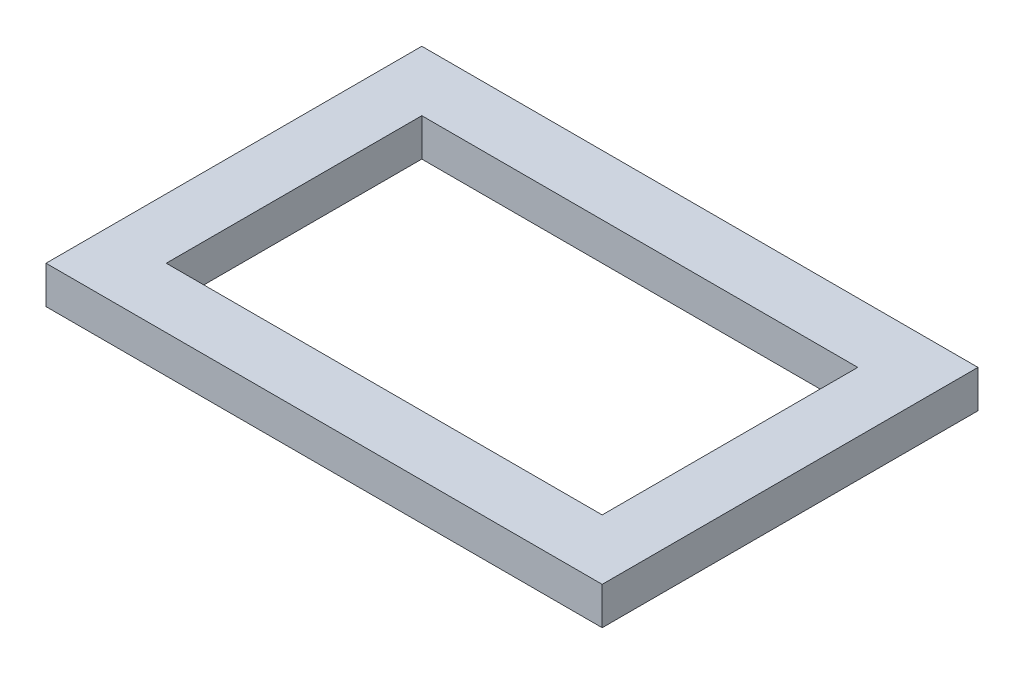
ISO-10303-21;
HEADER;
FILE_DESCRIPTION(('STEP AP214'),'2;1');
FILE_NAME('part.step','',(''),(''),'','','');
FILE_SCHEMA(('AUTOMOTIVE_DESIGN { 1 0 10303 214 1 1 1 1 }'));
ENDSEC;
DATA;
#1=APPLICATION_CONTEXT('core data for automotive mechanical design processes');
#2=APPLICATION_PROTOCOL_DEFINITION('international standard','automotive_design',2000,#1);
#3=PRODUCT_CONTEXT('',#1,'mechanical');
#4=PRODUCT('Part','Part','',(#3));
#5=PRODUCT_RELATED_PRODUCT_CATEGORY('part','',(#4));
#6=PRODUCT_DEFINITION_FORMATION('','',#4);
#7=PRODUCT_DEFINITION_CONTEXT('part definition',#1,'design');
#8=PRODUCT_DEFINITION('design','',#6,#7);
#9=PRODUCT_DEFINITION_SHAPE('','',#8);
#10=(LENGTH_UNIT() NAMED_UNIT(*) SI_UNIT(.MILLI.,.METRE.));
#11=(NAMED_UNIT(*) PLANE_ANGLE_UNIT() SI_UNIT($,.RADIAN.));
#12=(NAMED_UNIT(*) SI_UNIT($,.STERADIAN.) SOLID_ANGLE_UNIT());
#13=UNCERTAINTY_MEASURE_WITH_UNIT(LENGTH_MEASURE(1.E-05),#10,'distance_accuracy_value','');
#14=(GEOMETRIC_REPRESENTATION_CONTEXT(3) GLOBAL_UNCERTAINTY_ASSIGNED_CONTEXT((#13)) GLOBAL_UNIT_ASSIGNED_CONTEXT((#10,
#11,#12)) REPRESENTATION_CONTEXT('',''));
#15=CARTESIAN_POINT('',(0.,0.,0.));
#16=DIRECTION('',(0.,0.,1.));
#17=DIRECTION('',(1.,0.,0.));
#18=AXIS2_PLACEMENT_3D('',#15,#16,#17);
#19=CARTESIAN_POINT('',(0.,15.88,0.));
#20=DIRECTION('',(0.,-1.,0.));
#21=DIRECTION('',(0.,0.,-1.));
#22=AXIS2_PLACEMENT_3D('',#19,#20,#21);
#23=PLANE('',#22);
#24=DIRECTION('',(0.,0.,1.));
#25=VECTOR('',#24,1.);
#26=CARTESIAN_POINT('',(-117.475,15.88,79.375));
#27=LINE('',#26,#25);
#28=CARTESIAN_POINT('',(-117.475,15.88,-79.375));
#29=VERTEX_POINT('',#28);
#30=CARTESIAN_POINT('',(-117.475,15.88,79.375));
#31=VERTEX_POINT('',#30);
#32=EDGE_CURVE('E137',#29,#31,#27,.T.);
#33=ORIENTED_EDGE('',*,*,#32,.T.);
#34=DIRECTION('',(1.,0.,0.));
#35=VECTOR('',#34,1.);
#36=CARTESIAN_POINT('',(-117.475,15.88,79.375));
#37=LINE('',#36,#35);
#38=CARTESIAN_POINT('',(117.475,15.88,79.375));
#39=VERTEX_POINT('',#38);
#40=EDGE_CURVE('E140',#31,#39,#37,.T.);
#41=ORIENTED_EDGE('',*,*,#40,.T.);
#42=DIRECTION('',(0.,0.,-1.));
#43=VECTOR('',#42,1.);
#44=CARTESIAN_POINT('',(117.475,15.88,79.375));
#45=LINE('',#44,#43);
#46=CARTESIAN_POINT('',(117.475,15.88,-79.375));
#47=VERTEX_POINT('',#46);
#48=EDGE_CURVE('E143',#39,#47,#45,.T.);
#49=ORIENTED_EDGE('',*,*,#48,.T.);
#50=DIRECTION('',(-1.,0.,0.));
#51=VECTOR('',#50,1.);
#52=CARTESIAN_POINT('',(-117.475,15.88,-79.375));
#53=LINE('',#52,#51);
#54=EDGE_CURVE('E145',#47,#29,#53,.T.);
#55=ORIENTED_EDGE('',*,*,#54,.T.);
#56=EDGE_LOOP('',(#33,#41,#49,#55));
#57=FACE_BOUND('',#56,.T.);
#58=DIRECTION('',(0.,0.,-1.));
#59=VECTOR('',#58,1.);
#60=CARTESIAN_POINT('',(92.075,15.88,53.975));
#61=LINE('',#60,#59);
#62=CARTESIAN_POINT('',(92.075,15.88,53.975));
#63=VERTEX_POINT('',#62);
#64=CARTESIAN_POINT('',(92.075,15.88,-53.975));
#65=VERTEX_POINT('',#64);
#66=EDGE_CURVE('E101',#63,#65,#61,.T.);
#67=ORIENTED_EDGE('',*,*,#66,.F.);
#68=DIRECTION('',(1.,0.,0.));
#69=VECTOR('',#68,1.);
#70=CARTESIAN_POINT('',(-92.075,15.88,53.975));
#71=LINE('',#70,#69);
#72=CARTESIAN_POINT('',(-92.075,15.88,53.975));
#73=VERTEX_POINT('',#72);
#74=EDGE_CURVE('E123',#73,#63,#71,.T.);
#75=ORIENTED_EDGE('',*,*,#74,.F.);
#76=DIRECTION('',(0.,0.,1.));
#77=VECTOR('',#76,1.);
#78=CARTESIAN_POINT('',(-92.075,15.88,53.975));
#79=LINE('',#78,#77);
#80=CARTESIAN_POINT('',(-92.075,15.88,-53.975));
#81=VERTEX_POINT('',#80);
#82=EDGE_CURVE('E121',#81,#73,#79,.T.);
#83=ORIENTED_EDGE('',*,*,#82,.F.);
#84=DIRECTION('',(-1.,0.,0.));
#85=VECTOR('',#84,1.);
#86=CARTESIAN_POINT('',(-92.075,15.88,-53.975));
#87=LINE('',#86,#85);
#88=EDGE_CURVE('E109',#65,#81,#87,.T.);
#89=ORIENTED_EDGE('',*,*,#88,.F.);
#90=EDGE_LOOP('',(#67,#75,#83,#89));
#91=FACE_BOUND('',#90,.T.);
#92=ADVANCED_FACE('F36',(#57,#91),#23,.F.);
#93=CARTESIAN_POINT('',(0.,0.,0.));
#94=DIRECTION('',(0.,-1.,0.));
#95=DIRECTION('',(0.,0.,-1.));
#96=AXIS2_PLACEMENT_3D('',#93,#94,#95);
#97=PLANE('',#96);
#98=DIRECTION('',(0.,0.,1.));
#99=VECTOR('',#98,1.);
#100=CARTESIAN_POINT('',(-117.475,0.,79.375));
#101=LINE('',#100,#99);
#102=CARTESIAN_POINT('',(-117.475,0.,-79.375));
#103=VERTEX_POINT('',#102);
#104=CARTESIAN_POINT('',(-117.475,0.,79.375));
#105=VERTEX_POINT('',#104);
#106=EDGE_CURVE('E117',#103,#105,#101,.T.);
#107=ORIENTED_EDGE('',*,*,#106,.F.);
#108=DIRECTION('',(-1.,0.,0.));
#109=VECTOR('',#108,1.);
#110=CARTESIAN_POINT('',(-117.475,0.,-79.375));
#111=LINE('',#110,#109);
#112=CARTESIAN_POINT('',(117.475,0.,-79.375));
#113=VERTEX_POINT('',#112);
#114=EDGE_CURVE('E141',#113,#103,#111,.T.);
#115=ORIENTED_EDGE('',*,*,#114,.F.);
#116=DIRECTION('',(0.,0.,-1.));
#117=VECTOR('',#116,1.);
#118=CARTESIAN_POINT('',(117.475,0.,79.375));
#119=LINE('',#118,#117);
#120=CARTESIAN_POINT('',(117.475,0.,79.375));
#121=VERTEX_POINT('',#120);
#122=EDGE_CURVE('E152',#121,#113,#119,.T.);
#123=ORIENTED_EDGE('',*,*,#122,.F.);
#124=DIRECTION('',(1.,0.,0.));
#125=VECTOR('',#124,1.);
#126=CARTESIAN_POINT('',(-117.475,0.,79.375));
#127=LINE('',#126,#125);
#128=EDGE_CURVE('E150',#105,#121,#127,.T.);
#129=ORIENTED_EDGE('',*,*,#128,.F.);
#130=EDGE_LOOP('',(#107,#115,#123,#129));
#131=FACE_BOUND('',#130,.T.);
#132=DIRECTION('',(1.,0.,0.));
#133=VECTOR('',#132,1.);
#134=CARTESIAN_POINT('',(-92.075,0.,53.975));
#135=LINE('',#134,#133);
#136=CARTESIAN_POINT('',(-92.075,0.,53.975));
#137=VERTEX_POINT('',#136);
#138=CARTESIAN_POINT('',(92.075,0.,53.975));
#139=VERTEX_POINT('',#138);
#140=EDGE_CURVE('E110',#137,#139,#135,.T.);
#141=ORIENTED_EDGE('',*,*,#140,.T.);
#142=DIRECTION('',(0.,0.,-1.));
#143=VECTOR('',#142,1.);
#144=CARTESIAN_POINT('',(92.075,0.,53.975));
#145=LINE('',#144,#143);
#146=CARTESIAN_POINT('',(92.075,0.,-53.975));
#147=VERTEX_POINT('',#146);
#148=EDGE_CURVE('E59',#139,#147,#145,.T.);
#149=ORIENTED_EDGE('',*,*,#148,.T.);
#150=DIRECTION('',(-1.,0.,0.));
#151=VECTOR('',#150,1.);
#152=CARTESIAN_POINT('',(-92.075,0.,-53.975));
#153=LINE('',#152,#151);
#154=CARTESIAN_POINT('',(-92.075,0.,-53.975));
#155=VERTEX_POINT('',#154);
#156=EDGE_CURVE('E116',#147,#155,#153,.T.);
#157=ORIENTED_EDGE('',*,*,#156,.T.);
#158=DIRECTION('',(0.,0.,1.));
#159=VECTOR('',#158,1.);
#160=CARTESIAN_POINT('',(-92.075,0.,53.975));
#161=LINE('',#160,#159);
#162=EDGE_CURVE('E129',#155,#137,#161,.T.);
#163=ORIENTED_EDGE('',*,*,#162,.T.);
#164=EDGE_LOOP('',(#141,#149,#157,#163));
#165=FACE_BOUND('',#164,.T.);
#166=ADVANCED_FACE('F170',(#131,#165),#97,.T.);
#167=CARTESIAN_POINT('',(-117.475,15.88,79.375));
#168=DIRECTION('',(1.,0.,0.));
#169=DIRECTION('',(0.,0.,-1.));
#170=AXIS2_PLACEMENT_3D('',#167,#168,#169);
#171=PLANE('',#170);
#172=ORIENTED_EDGE('',*,*,#106,.T.);
#173=DIRECTION('',(0.,-1.,0.));
#174=VECTOR('',#173,1.);
#175=CARTESIAN_POINT('',(-117.475,15.88,79.375));
#176=LINE('',#175,#174);
#177=EDGE_CURVE('E11',#31,#105,#176,.T.);
#178=ORIENTED_EDGE('',*,*,#177,.F.);
#179=ORIENTED_EDGE('',*,*,#32,.F.);
#180=DIRECTION('',(0.,-1.,0.));
#181=VECTOR('',#180,1.);
#182=CARTESIAN_POINT('',(-117.475,15.88,-79.375));
#183=LINE('',#182,#181);
#184=EDGE_CURVE('E147',#29,#103,#183,.T.);
#185=ORIENTED_EDGE('',*,*,#184,.T.);
#186=EDGE_LOOP('',(#172,#178,#179,#185));
#187=FACE_BOUND('',#186,.T.);
#188=ADVANCED_FACE('F38',(#187),#171,.F.);
#189=CARTESIAN_POINT('',(-117.475,15.88,79.375));
#190=DIRECTION('',(0.,0.,-1.));
#191=DIRECTION('',(-1.,0.,0.));
#192=AXIS2_PLACEMENT_3D('',#189,#190,#191);
#193=PLANE('',#192);
#194=ORIENTED_EDGE('',*,*,#128,.T.);
#195=DIRECTION('',(0.,-1.,0.));
#196=VECTOR('',#195,1.);
#197=CARTESIAN_POINT('',(117.475,15.88,79.375));
#198=LINE('',#197,#196);
#199=EDGE_CURVE('E44',#39,#121,#198,.T.);
#200=ORIENTED_EDGE('',*,*,#199,.F.);
#201=ORIENTED_EDGE('',*,*,#40,.F.);
#202=ORIENTED_EDGE('',*,*,#177,.T.);
#203=EDGE_LOOP('',(#194,#200,#201,#202));
#204=FACE_BOUND('',#203,.T.);
#205=ADVANCED_FACE('F180',(#204),#193,.F.);
#206=CARTESIAN_POINT('',(117.475,15.88,79.375));
#207=DIRECTION('',(-1.,0.,0.));
#208=DIRECTION('',(0.,0.,1.));
#209=AXIS2_PLACEMENT_3D('',#206,#207,#208);
#210=PLANE('',#209);
#211=ORIENTED_EDGE('',*,*,#122,.T.);
#212=DIRECTION('',(0.,-1.,0.));
#213=VECTOR('',#212,1.);
#214=CARTESIAN_POINT('',(117.475,15.88,-79.375));
#215=LINE('',#214,#213);
#216=EDGE_CURVE('E157',#47,#113,#215,.T.);
#217=ORIENTED_EDGE('',*,*,#216,.F.);
#218=ORIENTED_EDGE('',*,*,#48,.F.);
#219=ORIENTED_EDGE('',*,*,#199,.T.);
#220=EDGE_LOOP('',(#211,#217,#218,#219));
#221=FACE_BOUND('',#220,.T.);
#222=ADVANCED_FACE('F164',(#221),#210,.F.);
#223=CARTESIAN_POINT('',(-117.475,15.88,-79.375));
#224=DIRECTION('',(0.,0.,1.));
#225=DIRECTION('',(1.,0.,0.));
#226=AXIS2_PLACEMENT_3D('',#223,#224,#225);
#227=PLANE('',#226);
#228=ORIENTED_EDGE('',*,*,#114,.T.);
#229=ORIENTED_EDGE('',*,*,#184,.F.);
#230=ORIENTED_EDGE('',*,*,#54,.F.);
#231=ORIENTED_EDGE('',*,*,#216,.T.);
#232=EDGE_LOOP('',(#228,#229,#230,#231));
#233=FACE_BOUND('',#232,.T.);
#234=ADVANCED_FACE('F174',(#233),#227,.F.);
#235=CARTESIAN_POINT('',(92.075,15.88,53.975));
#236=DIRECTION('',(-1.,0.,0.));
#237=DIRECTION('',(0.,0.,1.));
#238=AXIS2_PLACEMENT_3D('',#235,#236,#237);
#239=PLANE('',#238);
#240=ORIENTED_EDGE('',*,*,#148,.F.);
#241=DIRECTION('',(0.,-1.,0.));
#242=VECTOR('',#241,1.);
#243=CARTESIAN_POINT('',(92.075,15.88,53.975));
#244=LINE('',#243,#242);
#245=EDGE_CURVE('E105',#63,#139,#244,.T.);
#246=ORIENTED_EDGE('',*,*,#245,.F.);
#247=ORIENTED_EDGE('',*,*,#66,.T.);
#248=DIRECTION('',(0.,-1.,0.));
#249=VECTOR('',#248,1.);
#250=CARTESIAN_POINT('',(92.075,15.88,-53.975));
#251=LINE('',#250,#249);
#252=EDGE_CURVE('E104',#65,#147,#251,.T.);
#253=ORIENTED_EDGE('',*,*,#252,.T.);
#254=EDGE_LOOP('',(#240,#246,#247,#253));
#255=FACE_BOUND('',#254,.T.);
#256=ADVANCED_FACE('F103',(#255),#239,.T.);
#257=CARTESIAN_POINT('',(-92.075,15.88,-53.975));
#258=DIRECTION('',(0.,0.,1.));
#259=DIRECTION('',(1.,0.,0.));
#260=AXIS2_PLACEMENT_3D('',#257,#258,#259);
#261=PLANE('',#260);
#262=ORIENTED_EDGE('',*,*,#156,.F.);
#263=ORIENTED_EDGE('',*,*,#252,.F.);
#264=ORIENTED_EDGE('',*,*,#88,.T.);
#265=DIRECTION('',(0.,-1.,0.));
#266=VECTOR('',#265,1.);
#267=CARTESIAN_POINT('',(-92.075,15.88,-53.975));
#268=LINE('',#267,#266);
#269=EDGE_CURVE('E118',#81,#155,#268,.T.);
#270=ORIENTED_EDGE('',*,*,#269,.T.);
#271=EDGE_LOOP('',(#262,#263,#264,#270));
#272=FACE_BOUND('',#271,.T.);
#273=ADVANCED_FACE('F113',(#272),#261,.T.);
#274=CARTESIAN_POINT('',(-92.075,15.88,53.975));
#275=DIRECTION('',(1.,0.,0.));
#276=DIRECTION('',(0.,0.,-1.));
#277=AXIS2_PLACEMENT_3D('',#274,#275,#276);
#278=PLANE('',#277);
#279=ORIENTED_EDGE('',*,*,#162,.F.);
#280=ORIENTED_EDGE('',*,*,#269,.F.);
#281=ORIENTED_EDGE('',*,*,#82,.T.);
#282=DIRECTION('',(0.,-1.,0.));
#283=VECTOR('',#282,1.);
#284=CARTESIAN_POINT('',(-92.075,15.88,53.975));
#285=LINE('',#284,#283);
#286=EDGE_CURVE('E51',#73,#137,#285,.T.);
#287=ORIENTED_EDGE('',*,*,#286,.T.);
#288=EDGE_LOOP('',(#279,#280,#281,#287));
#289=FACE_BOUND('',#288,.T.);
#290=ADVANCED_FACE('F203',(#289),#278,.T.);
#291=CARTESIAN_POINT('',(-92.075,15.88,53.975));
#292=DIRECTION('',(0.,0.,-1.));
#293=DIRECTION('',(-1.,0.,0.));
#294=AXIS2_PLACEMENT_3D('',#291,#292,#293);
#295=PLANE('',#294);
#296=ORIENTED_EDGE('',*,*,#140,.F.);
#297=ORIENTED_EDGE('',*,*,#286,.F.);
#298=ORIENTED_EDGE('',*,*,#74,.T.);
#299=ORIENTED_EDGE('',*,*,#245,.T.);
#300=EDGE_LOOP('',(#296,#297,#298,#299));
#301=FACE_BOUND('',#300,.T.);
#302=ADVANCED_FACE('F207',(#301),#295,.T.);
#303=CLOSED_SHELL('',(#92,#166,#188,#205,#222,#234,#256,#273,#290,#302));
#304=MANIFOLD_SOLID_BREP('B2',#303);
#305=ADVANCED_BREP_SHAPE_REPRESENTATION('',(#18,#304),#14);
#306=SHAPE_DEFINITION_REPRESENTATION(#9,#305);
ENDSEC;
END-ISO-10303-21;
